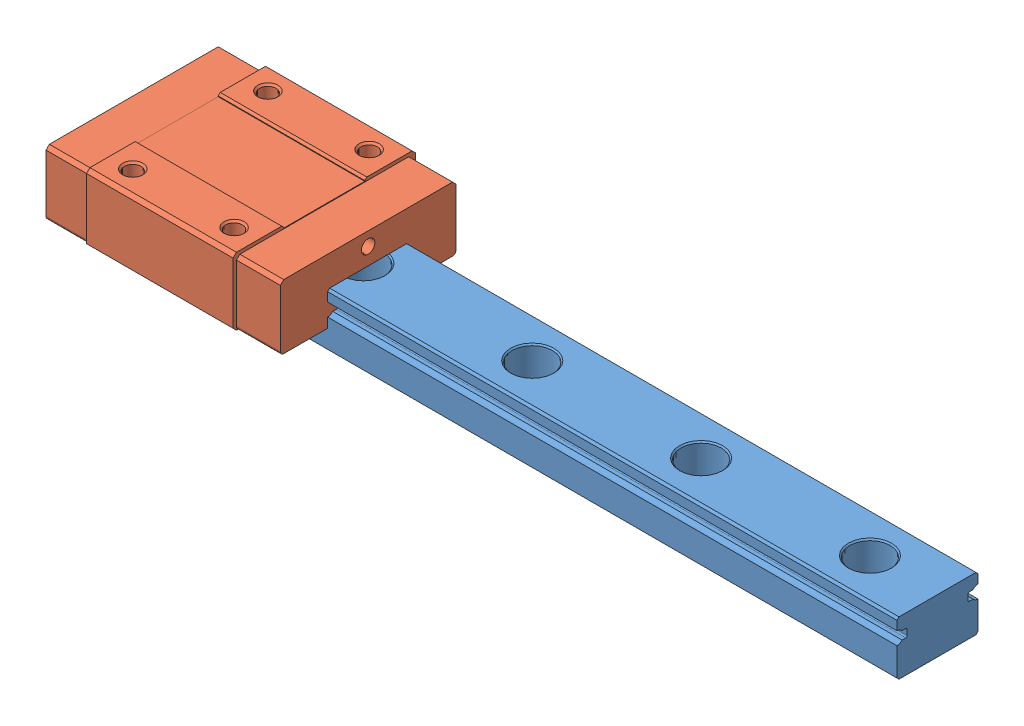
SolidWorks assembly MLN12C.stp.sldasm, configuration 默认 (file format 13000). Lengths in mm.
Overall size (120 13 27).
2 component instances, 2 part files, 0 mates.
Components (placement in the parent):
- MLNR12R120 E=10-1: MLNR12R120 E=10.SLDPRT [默认] at origin size (120 8 12)
- MLN12C-1: MLN12C.SLDPRT [默认] at (1 3 0) size (34.7 10 27)
